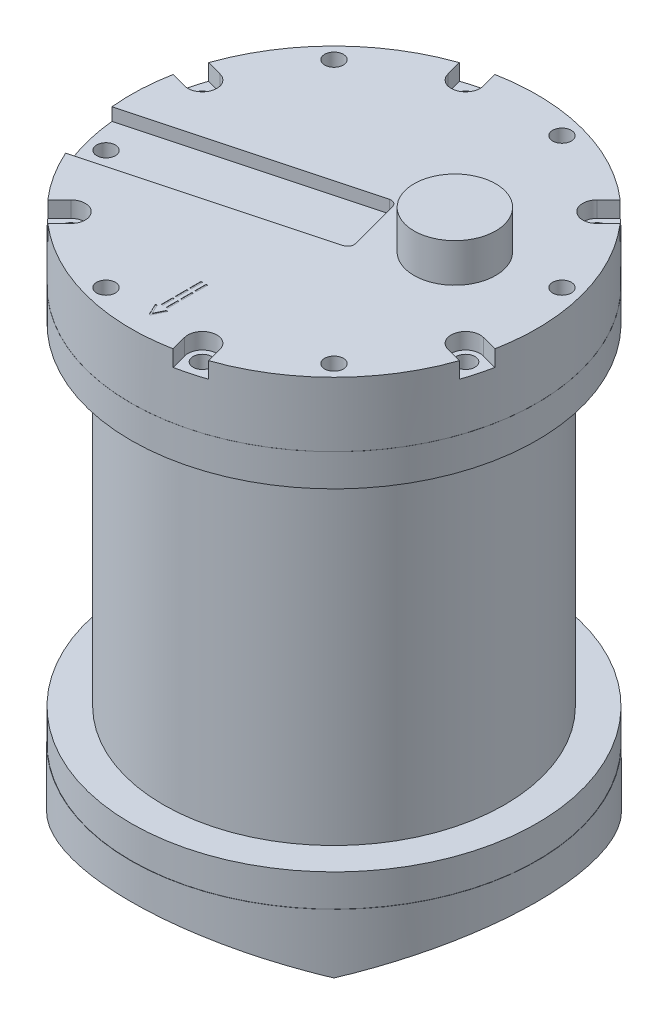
from build123d import *

# Parameters (mm, degrees)
SKETCH1_R                      = 63.1
EXTRUDE1_DEPTH                 = 31
SKETCH2_R                      = 63.025
EXTRUDE2_DEPTH                 = 10
SKETCH3_R                      = 53
EXTRUDE3_DEPTH                 = 103
X_DUCER_FACE_DEPTH             = 170.408441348
X_DUCER_FACE_DEPTH_BACK        = 170.408441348
CIRPATTERN1_COUNT              = 4
SKETCH5_R                      = 63.025
EXTRUDE5_DEPTH                 = 10
SKETCH6_R                      = 63
EXTRUDE6_DEPTH                 = 20
F_5_8_5_8_DIAMETER_HOLE1_D     = 5.8
F_5_8_5_8_DIAMETER_HOLE1_DEPTH = 30
CIRPATTERN2_COUNT              = 12
EXTRUDE8_DEPTH                 = 5
CIRPATTERN4_COUNT              = 6
EXTRUDE9_DEPTH                 = 3.94
SKETCH14_W                     = 0.474893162
SKETCH14_H                     = 3.527777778
SKETCH14_W_2                   = 0.474893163
SKETCH14_H_2                   = 3.527777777
EXTRUDE7_DEPTH                 = 0.1
SKETCH16_R                     = 12.682713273
ZINC_ANODE_DEPTH               = 12


with BuildPart() as part:
    # Sketch1 → Extrude1 (new body)
    with BuildSketch(Plane(origin=(0, 0, 0), x_dir=(1, 0, 0), z_dir=(0, 1, 0))):
        with Locations(Location((0, 0, 0), (0, 0, 270))):
            Circle(SKETCH1_R)
    extrude(amount=EXTRUDE1_DEPTH)

    # Sketch2 → Extrude2 (add)
    with BuildSketch(Plane(origin=(0, 31, 0), x_dir=(1, 0, 0), z_dir=(0, 1, 0))):
        with Locations(Location((0, 0, 0), (0, 0, 270))):
            Circle(SKETCH2_R)
    extrude(amount=EXTRUDE2_DEPTH)

    # Sketch3 → Extrude3 (add)
    with BuildSketch(Plane(origin=(0, 41, 0), x_dir=(1, 0, 0), z_dir=(0, 1, 0))):
        with Locations(Location((0, 0, 0), (0, 0, 270))):
            Circle(SKETCH3_R)
    extrude(amount=EXTRUDE3_DEPTH)

    # Sketch4 → X-ducer Face (cut, two sides: drawn at the far end of the back side and taken through both)
    with BuildSketch(Plane(origin=(0, 0, 0), x_dir=(0, 0, -1), z_dir=(1, 0, 0)).offset(-X_DUCER_FACE_DEPTH_BACK)):
        Polygon((4.191241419, -3.800683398), (63.1, 20), (72.716100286, -3.800683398), align=None)
    x_ducer_face = extrude(amount=X_DUCER_FACE_DEPTH + X_DUCER_FACE_DEPTH_BACK, mode=Mode.SUBTRACT)

    # CirPattern1: X-ducer Face ×4 about axis
    cirpattern1_axis = Axis((0, 0, 0), (0, 1, 0))
    for i in range(1, CIRPATTERN1_COUNT):
        add(x_ducer_face.rotate(cirpattern1_axis, i * 360 / CIRPATTERN1_COUNT), mode=Mode.SUBTRACT)

    # Sketch5 → Extrude5 (add)
    with BuildSketch(Plane(origin=(0, 144, 0), x_dir=(1, 0, 0), z_dir=(0, 1, 0))):
        with Locations(Location((0, 0, 0), (0, 0, 270))):
            Circle(SKETCH5_R)
    extrude(amount=EXTRUDE5_DEPTH)

    # Sketch6 → Extrude6 (add)
    with BuildSketch(Plane(origin=(0, 154, 0), x_dir=(1, 0, 0), z_dir=(0, 1, 0))):
        with Locations(Location((0, 0, 0), (0, 0, 270))):
            Circle(SKETCH6_R)
    extrude(amount=EXTRUDE6_DEPTH)

    # 5.8 _5.8_ Diameter Hole1
    with Locations(Plane(origin=(0, 174, 0), x_dir=(-1, 0, 0), z_dir=(0, 1, 0))):
        with Locations((55.83051276, 14.959740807)):
            f_5_8_5_8_diameter_hole1 = Hole(F_5_8_5_8_DIAMETER_HOLE1_D / 2, depth=F_5_8_5_8_DIAMETER_HOLE1_DEPTH)

    # CirPattern2: 5.8 _5.8_ Diameter Hole1 ×12 about axis
    cirpattern2_axis = Axis((0, 0, 0), (0, 1, 0))
    for i in range(1, CIRPATTERN2_COUNT):
        add(f_5_8_5_8_diameter_hole1.rotate(cirpattern2_axis, i * 360 / CIRPATTERN2_COUNT), mode=Mode.SUBTRACT)

    # Sketch15 → Extrude8 (cut)
    with BuildSketch(Plane(origin=(0, 174, 0), x_dir=(1, 0, 0), z_dir=(0, 1, 0))):
        with BuildLine():
            Line((-54.665827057, 19.306407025), (-72.756523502, 24.153794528))
            Line((-72.756523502, 24.153794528), (-66.392562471, 13.131090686))
            Line((-66.392562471, 13.131090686), (-56.995198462, 10.613074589))
            ThreePointArc((-56.995198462, 10.613074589), (-51.483846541, 13.795055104), (-54.665827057, 19.306407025))
        make_face()
    extrude8 = extrude(amount=-EXTRUDE8_DEPTH, mode=Mode.SUBTRACT)

    # CirPattern4: Extrude8 ×6 about axis
    cirpattern4_axis = Axis((0, 0, 0), (0, 1, 0))
    for i in range(1, CIRPATTERN4_COUNT):
        add(extrude8.rotate(cirpattern4_axis, i * 360 / CIRPATTERN4_COUNT), mode=Mode.SUBTRACT)

    # Sketch17 → Extrude9 (cut)
    with BuildSketch(Plane(origin=(0, 174, 0), x_dir=(1, 0, 0), z_dir=(0, 1, 0))):
        with BuildLine():
            Line((5.252353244, 11.925769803), (-77.503398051, -10.248566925))
            Line((-77.503398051, -10.248566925), (-72.244195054, -29.876179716))
            Line((-72.244195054, -29.876179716), (10.511556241, -7.701842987))
            ThreePointArc((10.511556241, -7.701842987), (11.725968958, -6.769991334), (11.925769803, -5.252353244))
            Line((11.925769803, -5.252353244), (7.701842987, 10.511556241))
            ThreePointArc((7.701842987, 10.511556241), (6.769991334, 11.725968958), (5.252353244, 11.925769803))
        make_face()
    extrude(amount=-EXTRUDE9_DEPTH, mode=Mode.SUBTRACT)

    # Sketch14 → Extrude7 (cut)
    with BuildSketch(Plane(origin=(0, 174, 0), x_dir=(1, 0, 0), z_dir=(0, 1, 0))):
        with Locations((-0.073985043, -41.157088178)):
            Rectangle(SKETCH14_W, SKETCH14_H)
        with Locations((-1.634348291, -41.157088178)):
            Rectangle(SKETCH14_W_2, SKETCH14_H)
        with Locations((-0.073985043, -45.5668104)):
            Rectangle(SKETCH14_W, SKETCH14_H)
        with Locations((-1.634348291, -45.5668104)):
            Rectangle(SKETCH14_W_2, SKETCH14_H)
        with Locations((-0.073985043, -49.976532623)):
            Rectangle(SKETCH14_W, SKETCH14_H_2)
        with Locations((-1.634348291, -49.976532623)):
            Rectangle(SKETCH14_W_2, SKETCH14_H_2)
        Polygon((-2.305346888, -52.622365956), (-0.888087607, -55.59256828), (0.529171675, -52.622365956), (1.045405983, -52.622365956), (-0.702582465, -56.285827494), (-1.073592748, -56.285827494), (-2.821581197, -52.622365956), align=None)
    extrude(amount=-EXTRUDE7_DEPTH, mode=Mode.SUBTRACT)

    # Sketch16 → Zinc Anode (add)
    with BuildSketch(Plane(origin=(0, 174, 0), x_dir=(1, 0, 0), z_dir=(0, 1, 0))):
        with Locations(Location((29.598960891, 7.931017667, 0), (0, 0, 270))):
            Circle(SKETCH16_R)
    extrude(amount=ZINC_ANODE_DEPTH)


solid = part.part
